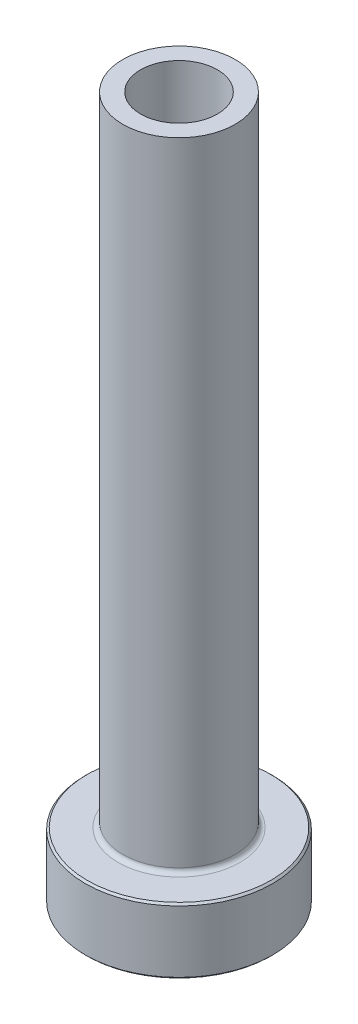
ISO-10303-21;
HEADER;
FILE_DESCRIPTION(('STEP AP214'),'2;1');
FILE_NAME('part.step','',(''),(''),'','','');
FILE_SCHEMA(('AUTOMOTIVE_DESIGN { 1 0 10303 214 1 1 1 1 }'));
ENDSEC;
DATA;
#1=APPLICATION_CONTEXT('core data for automotive mechanical design processes');
#2=APPLICATION_PROTOCOL_DEFINITION('international standard','automotive_design',2000,#1);
#3=PRODUCT_CONTEXT('',#1,'mechanical');
#4=PRODUCT('Part','Part','',(#3));
#5=PRODUCT_RELATED_PRODUCT_CATEGORY('part','',(#4));
#6=PRODUCT_DEFINITION_FORMATION('','',#4);
#7=PRODUCT_DEFINITION_CONTEXT('part definition',#1,'design');
#8=PRODUCT_DEFINITION('design','',#6,#7);
#9=PRODUCT_DEFINITION_SHAPE('','',#8);
#10=(LENGTH_UNIT() NAMED_UNIT(*) SI_UNIT(.MILLI.,.METRE.));
#11=(NAMED_UNIT(*) PLANE_ANGLE_UNIT() SI_UNIT($,.RADIAN.));
#12=(NAMED_UNIT(*) SI_UNIT($,.STERADIAN.) SOLID_ANGLE_UNIT());
#13=UNCERTAINTY_MEASURE_WITH_UNIT(LENGTH_MEASURE(1.E-05),#10,'distance_accuracy_value','');
#14=(GEOMETRIC_REPRESENTATION_CONTEXT(3) GLOBAL_UNCERTAINTY_ASSIGNED_CONTEXT((#13)) GLOBAL_UNIT_ASSIGNED_CONTEXT((#10,
#11,#12)) REPRESENTATION_CONTEXT('',''));
#15=CARTESIAN_POINT('',(0.,0.,0.));
#16=DIRECTION('',(0.,0.,1.));
#17=DIRECTION('',(1.,0.,0.));
#18=AXIS2_PLACEMENT_3D('',#15,#16,#17);
#19=CARTESIAN_POINT('',(0.,92.1876809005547,0.));
#20=DIRECTION('',(0.,1.,0.));
#21=DIRECTION('',(0.,0.,1.));
#22=AXIS2_PLACEMENT_3D('',#19,#20,#21);
#23=CYLINDRICAL_SURFACE('',#22,4.10000000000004);
#24=CARTESIAN_POINT('',(0.,75.,0.));
#25=DIRECTION('',(0.,1.,0.));
#26=DIRECTION('',(0.,0.,1.));
#27=AXIS2_PLACEMENT_3D('',#24,#25,#26);
#28=CIRCLE('',#27,4.10000000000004);
#29=CARTESIAN_POINT('',(0.,75.,4.10000000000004));
#30=VERTEX_POINT('',#29);
#31=EDGE_CURVE('E62',#30,#30,#28,.T.);
#32=ORIENTED_EDGE('',*,*,#31,.T.);
#33=EDGE_LOOP('',(#32));
#34=FACE_BOUND('',#33,.T.);
#35=CARTESIAN_POINT('',(0.,30.,0.));
#36=DIRECTION('',(0.,1.,0.));
#37=DIRECTION('',(0.,0.,1.));
#38=AXIS2_PLACEMENT_3D('',#35,#36,#37);
#39=CIRCLE('',#38,4.10000000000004);
#40=CARTESIAN_POINT('',(0.,30.,4.10000000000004));
#41=VERTEX_POINT('',#40);
#42=EDGE_CURVE('E71',#41,#41,#39,.T.);
#43=ORIENTED_EDGE('',*,*,#42,.F.);
#44=EDGE_LOOP('',(#43));
#45=FACE_BOUND('',#44,.T.);
#46=ADVANCED_FACE('F30',(#34,#45),#23,.F.);
#47=CARTESIAN_POINT('',(-4.10000000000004,75.,0.));
#48=DIRECTION('',(0.,1.,0.));
#49=DIRECTION('',(0.,0.,1.));
#50=AXIS2_PLACEMENT_3D('',#47,#48,#49);
#51=PLANE('',#50);
#52=CARTESIAN_POINT('',(0.,75.,0.));
#53=DIRECTION('',(0.,1.,0.));
#54=DIRECTION('',(0.,0.,1.));
#55=AXIS2_PLACEMENT_3D('',#52,#53,#54);
#56=CIRCLE('',#55,6.);
#57=CARTESIAN_POINT('',(0.,75.,6.));
#58=VERTEX_POINT('',#57);
#59=EDGE_CURVE('E65',#58,#58,#56,.T.);
#60=ORIENTED_EDGE('',*,*,#59,.T.);
#61=EDGE_LOOP('',(#60));
#62=FACE_BOUND('',#61,.T.);
#63=ORIENTED_EDGE('',*,*,#31,.F.);
#64=EDGE_LOOP('',(#63));
#65=FACE_BOUND('',#64,.T.);
#66=ADVANCED_FACE('F79',(#62,#65),#51,.T.);
#67=CARTESIAN_POINT('',(0.,92.1876809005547,0.));
#68=DIRECTION('',(0.,1.,0.));
#69=DIRECTION('',(0.,0.,1.));
#70=AXIS2_PLACEMENT_3D('',#67,#68,#69);
#71=CYLINDRICAL_SURFACE('',#70,5.99999999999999);
#72=CARTESIAN_POINT('',(0.,7.50000000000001,0.));
#73=DIRECTION('',(0.,1.,0.));
#74=DIRECTION('',(0.,0.,1.));
#75=AXIS2_PLACEMENT_3D('',#72,#73,#74);
#76=CIRCLE('',#75,5.99999999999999);
#77=CARTESIAN_POINT('',(0.,7.50000000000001,5.99999999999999));
#78=VERTEX_POINT('',#77);
#79=EDGE_CURVE('E59',#78,#78,#76,.T.);
#80=ORIENTED_EDGE('',*,*,#79,.T.);
#81=EDGE_LOOP('',(#80));
#82=FACE_BOUND('',#81,.T.);
#83=ORIENTED_EDGE('',*,*,#59,.F.);
#84=EDGE_LOOP('',(#83));
#85=FACE_BOUND('',#84,.T.);
#86=ADVANCED_FACE('F85',(#82,#85),#71,.T.);
#87=CARTESIAN_POINT('',(-5.99999999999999,7.,0.));
#88=DIRECTION('',(0.,1.,0.));
#89=DIRECTION('',(0.,0.,1.));
#90=AXIS2_PLACEMENT_3D('',#87,#88,#89);
#91=PLANE('',#90);
#92=CARTESIAN_POINT('',(0.,7.,0.));
#93=DIRECTION('',(0.,1.,0.));
#94=DIRECTION('',(0.,0.,1.));
#95=AXIS2_PLACEMENT_3D('',#92,#93,#94);
#96=CIRCLE('',#95,9.8);
#97=CARTESIAN_POINT('',(0.,7.,9.8));
#98=VERTEX_POINT('',#97);
#99=EDGE_CURVE('E53',#98,#98,#96,.T.);
#100=ORIENTED_EDGE('',*,*,#99,.T.);
#101=EDGE_LOOP('',(#100));
#102=FACE_BOUND('',#101,.T.);
#103=CARTESIAN_POINT('',(0.,7.,0.));
#104=DIRECTION('',(0.,1.,0.));
#105=DIRECTION('',(0.,0.,1.));
#106=AXIS2_PLACEMENT_3D('',#103,#104,#105);
#107=CIRCLE('',#106,6.49999999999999);
#108=CARTESIAN_POINT('',(0.,7.,6.49999999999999));
#109=VERTEX_POINT('',#108);
#110=EDGE_CURVE('E56',#109,#109,#107,.F.);
#111=ORIENTED_EDGE('',*,*,#110,.T.);
#112=EDGE_LOOP('',(#111));
#113=FACE_BOUND('',#112,.T.);
#114=ADVANCED_FACE('F111',(#102,#113),#91,.T.);
#115=CARTESIAN_POINT('',(0.,92.1876809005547,0.));
#116=DIRECTION('',(0.,1.,0.));
#117=DIRECTION('',(0.,0.,1.));
#118=AXIS2_PLACEMENT_3D('',#115,#116,#117);
#119=CYLINDRICAL_SURFACE('',#118,9.99999999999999);
#120=CARTESIAN_POINT('',(0.,6.8,0.));
#121=DIRECTION('',(0.,1.,0.));
#122=DIRECTION('',(0.,0.,1.));
#123=AXIS2_PLACEMENT_3D('',#120,#121,#122);
#124=CIRCLE('',#123,9.99999999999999);
#125=CARTESIAN_POINT('',(0.,6.8,9.99999999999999));
#126=VERTEX_POINT('',#125);
#127=EDGE_CURVE('E45',#126,#126,#124,.F.);
#128=ORIENTED_EDGE('',*,*,#127,.T.);
#129=EDGE_LOOP('',(#128));
#130=FACE_BOUND('',#129,.T.);
#131=CARTESIAN_POINT('',(0.,0.200000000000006,0.));
#132=DIRECTION('',(0.,-1.,0.));
#133=DIRECTION('',(0.,0.,-1.));
#134=AXIS2_PLACEMENT_3D('',#131,#132,#133);
#135=CIRCLE('',#134,9.99999999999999);
#136=CARTESIAN_POINT('',(0.,0.200000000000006,-9.99999999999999));
#137=VERTEX_POINT('',#136);
#138=EDGE_CURVE('E50',#137,#137,#135,.F.);
#139=ORIENTED_EDGE('',*,*,#138,.T.);
#140=EDGE_LOOP('',(#139));
#141=FACE_BOUND('',#140,.T.);
#142=ADVANCED_FACE('F108',(#130,#141),#119,.T.);
#143=CARTESIAN_POINT('',(-9.99999999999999,0.,0.));
#144=DIRECTION('',(0.,-1.,0.));
#145=DIRECTION('',(0.,0.,-1.));
#146=AXIS2_PLACEMENT_3D('',#143,#144,#145);
#147=PLANE('',#146);
#148=CARTESIAN_POINT('',(0.,0.,0.));
#149=DIRECTION('',(0.,-1.,0.));
#150=DIRECTION('',(0.,0.,-1.));
#151=AXIS2_PLACEMENT_3D('',#148,#149,#150);
#152=CIRCLE('',#151,4.84999999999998);
#153=CARTESIAN_POINT('',(0.,0.,-4.84999999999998));
#154=VERTEX_POINT('',#153);
#155=EDGE_CURVE('E37',#154,#154,#152,.F.);
#156=ORIENTED_EDGE('',*,*,#155,.T.);
#157=EDGE_LOOP('',(#156));
#158=FACE_BOUND('',#157,.T.);
#159=CARTESIAN_POINT('',(0.,0.,0.));
#160=DIRECTION('',(0.,-1.,0.));
#161=DIRECTION('',(0.,0.,-1.));
#162=AXIS2_PLACEMENT_3D('',#159,#160,#161);
#163=CIRCLE('',#162,9.79999999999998);
#164=CARTESIAN_POINT('',(0.,0.,-9.79999999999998));
#165=VERTEX_POINT('',#164);
#166=EDGE_CURVE('E41',#165,#165,#163,.T.);
#167=ORIENTED_EDGE('',*,*,#166,.T.);
#168=EDGE_LOOP('',(#167));
#169=FACE_BOUND('',#168,.T.);
#170=ADVANCED_FACE('F110',(#158,#169),#147,.T.);
#171=CARTESIAN_POINT('',(0.,92.1876809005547,0.));
#172=DIRECTION('',(0.,1.,0.));
#173=DIRECTION('',(0.,0.,1.));
#174=AXIS2_PLACEMENT_3D('',#171,#172,#173);
#175=CYLINDRICAL_SURFACE('',#174,4.34999999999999);
#176=CARTESIAN_POINT('',(0.,0.5,0.));
#177=DIRECTION('',(0.,-1.,0.));
#178=DIRECTION('',(0.,0.,-1.));
#179=AXIS2_PLACEMENT_3D('',#176,#177,#178);
#180=CIRCLE('',#179,4.34999999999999);
#181=CARTESIAN_POINT('',(0.,0.5,-4.34999999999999));
#182=VERTEX_POINT('',#181);
#183=EDGE_CURVE('E10',#182,#182,#180,.T.);
#184=ORIENTED_EDGE('',*,*,#183,.T.);
#185=EDGE_LOOP('',(#184));
#186=FACE_BOUND('',#185,.T.);
#187=CARTESIAN_POINT('',(0.,18.,0.));
#188=DIRECTION('',(0.,1.,0.));
#189=DIRECTION('',(0.,0.,1.));
#190=AXIS2_PLACEMENT_3D('',#187,#188,#189);
#191=CIRCLE('',#190,4.34999999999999);
#192=CARTESIAN_POINT('',(0.,18.,4.34999999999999));
#193=VERTEX_POINT('',#192);
#194=EDGE_CURVE('E68',#193,#193,#191,.T.);
#195=ORIENTED_EDGE('',*,*,#194,.T.);
#196=EDGE_LOOP('',(#195));
#197=FACE_BOUND('',#196,.T.);
#198=ADVANCED_FACE('F118',(#186,#197),#175,.F.);
#199=CARTESIAN_POINT('',(0.,18.,0.));
#200=DIRECTION('',(0.,-1.,0.));
#201=DIRECTION('',(0.,0.,-1.));
#202=AXIS2_PLACEMENT_3D('',#199,#200,#201);
#203=CONICAL_SURFACE('',#202,4.34999999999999,0.0208303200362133);
#204=ORIENTED_EDGE('',*,*,#42,.T.);
#205=EDGE_LOOP('',(#204));
#206=FACE_BOUND('',#205,.T.);
#207=ORIENTED_EDGE('',*,*,#194,.F.);
#208=EDGE_LOOP('',(#207));
#209=FACE_BOUND('',#208,.T.);
#210=ADVANCED_FACE('F75',(#206,#209),#203,.F.);
#211=CARTESIAN_POINT('',(0.,7.50000000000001,0.));
#212=DIRECTION('',(0.,1.,0.));
#213=DIRECTION('',(0.,0.,1.));
#214=AXIS2_PLACEMENT_3D('',#211,#212,#213);
#215=TOROIDAL_SURFACE('',#214,6.49999999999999,0.5);
#216=ORIENTED_EDGE('',*,*,#110,.F.);
#217=EDGE_LOOP('',(#216));
#218=FACE_BOUND('',#217,.T.);
#219=ORIENTED_EDGE('',*,*,#79,.F.);
#220=EDGE_LOOP('',(#219));
#221=FACE_BOUND('',#220,.T.);
#222=ADVANCED_FACE('F90',(#218,#221),#215,.F.);
#223=CARTESIAN_POINT('',(0.,7.00000000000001,0.));
#224=DIRECTION('',(0.,-1.,0.));
#225=DIRECTION('',(0.,0.,-1.));
#226=AXIS2_PLACEMENT_3D('',#223,#224,#225);
#227=CONICAL_SURFACE('',#226,9.8,0.785398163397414);
#228=ORIENTED_EDGE('',*,*,#127,.F.);
#229=EDGE_LOOP('',(#228));
#230=FACE_BOUND('',#229,.T.);
#231=ORIENTED_EDGE('',*,*,#99,.F.);
#232=EDGE_LOOP('',(#231));
#233=FACE_BOUND('',#232,.T.);
#234=ADVANCED_FACE('F93',(#230,#233),#227,.T.);
#235=CARTESIAN_POINT('',(0.,0.200000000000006,0.));
#236=DIRECTION('',(0.,1.,0.));
#237=DIRECTION('',(0.,0.,1.));
#238=AXIS2_PLACEMENT_3D('',#235,#236,#237);
#239=CONICAL_SURFACE('',#238,9.99999999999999,0.785398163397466);
#240=ORIENTED_EDGE('',*,*,#166,.F.);
#241=EDGE_LOOP('',(#240));
#242=FACE_BOUND('',#241,.T.);
#243=ORIENTED_EDGE('',*,*,#138,.F.);
#244=EDGE_LOOP('',(#243));
#245=FACE_BOUND('',#244,.T.);
#246=ADVANCED_FACE('F96',(#242,#245),#239,.T.);
#247=CARTESIAN_POINT('',(0.,0.,0.));
#248=DIRECTION('',(0.,-1.,0.));
#249=DIRECTION('',(0.,0.,-1.));
#250=AXIS2_PLACEMENT_3D('',#247,#248,#249);
#251=CONICAL_SURFACE('',#250,4.84999999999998,0.785398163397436);
#252=ORIENTED_EDGE('',*,*,#183,.F.);
#253=EDGE_LOOP('',(#252));
#254=FACE_BOUND('',#253,.T.);
#255=ORIENTED_EDGE('',*,*,#155,.F.);
#256=EDGE_LOOP('',(#255));
#257=FACE_BOUND('',#256,.T.);
#258=ADVANCED_FACE('F32',(#254,#257),#251,.F.);
#259=CLOSED_SHELL('',(#46,#66,#86,#114,#142,#170,#198,#210,#222,#234,#246,#258));
#260=MANIFOLD_SOLID_BREP('B2',#259);
#261=ADVANCED_BREP_SHAPE_REPRESENTATION('',(#18,#260),#14);
#262=SHAPE_DEFINITION_REPRESENTATION(#9,#261);
ENDSEC;
END-ISO-10303-21;
